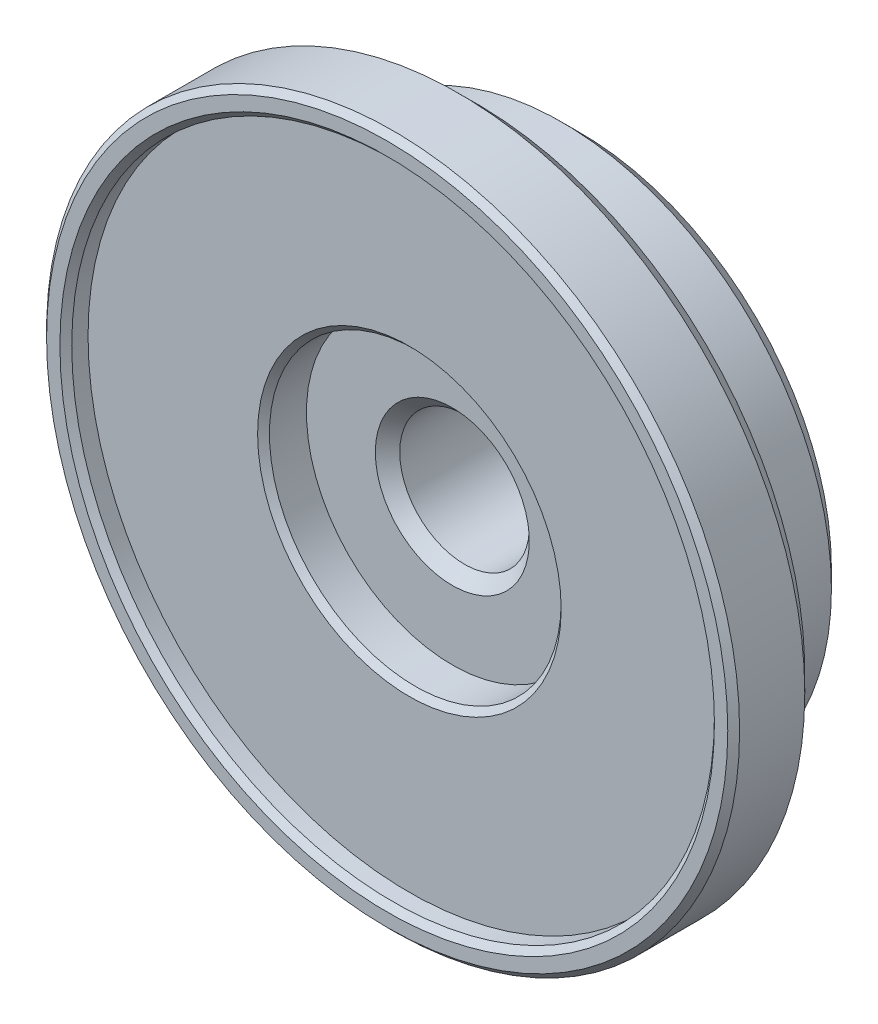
ISO-10303-21;
HEADER;
FILE_DESCRIPTION(('STEP AP214'),'2;1');
FILE_NAME('part.step','',(''),(''),'','','');
FILE_SCHEMA(('AUTOMOTIVE_DESIGN { 1 0 10303 214 1 1 1 1 }'));
ENDSEC;
DATA;
#1=APPLICATION_CONTEXT('core data for automotive mechanical design processes');
#2=APPLICATION_PROTOCOL_DEFINITION('international standard','automotive_design',2000,#1);
#3=PRODUCT_CONTEXT('',#1,'mechanical');
#4=PRODUCT('Part','Part','',(#3));
#5=PRODUCT_RELATED_PRODUCT_CATEGORY('part','',(#4));
#6=PRODUCT_DEFINITION_FORMATION('','',#4);
#7=PRODUCT_DEFINITION_CONTEXT('part definition',#1,'design');
#8=PRODUCT_DEFINITION('design','',#6,#7);
#9=PRODUCT_DEFINITION_SHAPE('','',#8);
#10=(LENGTH_UNIT() NAMED_UNIT(*) SI_UNIT(.MILLI.,.METRE.));
#11=(NAMED_UNIT(*) PLANE_ANGLE_UNIT() SI_UNIT($,.RADIAN.));
#12=(NAMED_UNIT(*) SI_UNIT($,.STERADIAN.) SOLID_ANGLE_UNIT());
#13=UNCERTAINTY_MEASURE_WITH_UNIT(LENGTH_MEASURE(1.E-05),#10,'distance_accuracy_value','');
#14=(GEOMETRIC_REPRESENTATION_CONTEXT(3) GLOBAL_UNCERTAINTY_ASSIGNED_CONTEXT((#13)) GLOBAL_UNIT_ASSIGNED_CONTEXT((#10,
#11,#12)) REPRESENTATION_CONTEXT('',''));
#15=CARTESIAN_POINT('',(0.,0.,0.));
#16=DIRECTION('',(0.,0.,1.));
#17=DIRECTION('',(1.,0.,0.));
#18=AXIS2_PLACEMENT_3D('',#15,#16,#17);
#19=CARTESIAN_POINT('',(0.,0.,-16.51));
#20=DIRECTION('',(0.,0.,1.));
#21=DIRECTION('',(1.,0.,0.));
#22=AXIS2_PLACEMENT_3D('',#19,#20,#21);
#23=CYLINDRICAL_SURFACE('',#22,29.718);
#24=CARTESIAN_POINT('',(0.,0.,-0.508000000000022));
#25=DIRECTION('',(0.,0.,1.));
#26=DIRECTION('',(1.,0.,0.));
#27=AXIS2_PLACEMENT_3D('',#24,#25,#26);
#28=CIRCLE('',#27,29.718);
#29=CARTESIAN_POINT('',(29.718,0.,-0.508000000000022));
#30=VERTEX_POINT('',#29);
#31=EDGE_CURVE('E32',#30,#30,#28,.F.);
#32=ORIENTED_EDGE('',*,*,#31,.T.);
#33=EDGE_LOOP('',(#32));
#34=FACE_BOUND('',#33,.T.);
#35=CARTESIAN_POINT('',(0.,0.,-6.09599999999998));
#36=DIRECTION('',(0.,0.,-1.));
#37=DIRECTION('',(-1.,0.,0.));
#38=AXIS2_PLACEMENT_3D('',#35,#36,#37);
#39=CIRCLE('',#38,29.718);
#40=CARTESIAN_POINT('',(-29.718,0.,-6.09599999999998));
#41=VERTEX_POINT('',#40);
#42=EDGE_CURVE('E57',#41,#41,#39,.F.);
#43=ORIENTED_EDGE('',*,*,#42,.T.);
#44=EDGE_LOOP('',(#43));
#45=FACE_BOUND('',#44,.T.);
#46=ADVANCED_FACE('F14',(#34,#45),#23,.T.);
#47=CARTESIAN_POINT('',(0.,0.,0.));
#48=DIRECTION('',(0.,0.,1.));
#49=DIRECTION('',(1.,0.,0.));
#50=AXIS2_PLACEMENT_3D('',#47,#48,#49);
#51=PLANE('',#50);
#52=CARTESIAN_POINT('',(0.,0.,0.));
#53=DIRECTION('',(0.,0.,1.));
#54=DIRECTION('',(1.,0.,0.));
#55=AXIS2_PLACEMENT_3D('',#52,#53,#54);
#56=CIRCLE('',#55,28.067);
#57=CARTESIAN_POINT('',(28.067,0.,0.));
#58=VERTEX_POINT('',#57);
#59=EDGE_CURVE('E93',#58,#58,#56,.F.);
#60=ORIENTED_EDGE('',*,*,#59,.T.);
#61=EDGE_LOOP('',(#60));
#62=FACE_BOUND('',#61,.T.);
#63=CARTESIAN_POINT('',(0.,0.,0.));
#64=DIRECTION('',(0.,0.,1.));
#65=DIRECTION('',(1.,0.,0.));
#66=AXIS2_PLACEMENT_3D('',#63,#64,#65);
#67=CIRCLE('',#66,29.21);
#68=CARTESIAN_POINT('',(29.21,0.,0.));
#69=VERTEX_POINT('',#68);
#70=EDGE_CURVE('E40',#69,#69,#67,.T.);
#71=ORIENTED_EDGE('',*,*,#70,.T.);
#72=EDGE_LOOP('',(#71));
#73=FACE_BOUND('',#72,.T.);
#74=ADVANCED_FACE('F131',(#62,#73),#51,.T.);
#75=CARTESIAN_POINT('',(0.,0.,-7.62));
#76=DIRECTION('',(0.,0.,-1.));
#77=DIRECTION('',(-1.,0.,0.));
#78=AXIS2_PLACEMENT_3D('',#75,#76,#77);
#79=PLANE('',#78);
#80=CARTESIAN_POINT('',(0.,0.,-7.62));
#81=DIRECTION('',(0.,0.,-1.));
#82=DIRECTION('',(-1.,0.,0.));
#83=AXIS2_PLACEMENT_3D('',#80,#81,#82);
#84=CIRCLE('',#83,23.876);
#85=CARTESIAN_POINT('',(-23.876,0.,-7.62));
#86=VERTEX_POINT('',#85);
#87=EDGE_CURVE('E9',#86,#86,#84,.F.);
#88=ORIENTED_EDGE('',*,*,#87,.T.);
#89=EDGE_LOOP('',(#88));
#90=FACE_BOUND('',#89,.T.);
#91=CARTESIAN_POINT('',(0.,0.,-7.62));
#92=DIRECTION('',(0.,0.,-1.));
#93=DIRECTION('',(-1.,0.,0.));
#94=AXIS2_PLACEMENT_3D('',#91,#92,#93);
#95=CIRCLE('',#94,28.194);
#96=CARTESIAN_POINT('',(-28.194,0.,-7.62));
#97=VERTEX_POINT('',#96);
#98=EDGE_CURVE('E54',#97,#97,#95,.T.);
#99=ORIENTED_EDGE('',*,*,#98,.T.);
#100=EDGE_LOOP('',(#99));
#101=FACE_BOUND('',#100,.T.);
#102=ADVANCED_FACE('F138',(#90,#101),#79,.T.);
#103=CARTESIAN_POINT('',(0.,0.,-7.62));
#104=DIRECTION('',(0.,0.,-1.));
#105=DIRECTION('',(-1.,0.,0.));
#106=AXIS2_PLACEMENT_3D('',#103,#104,#105);
#107=CYLINDRICAL_SURFACE('',#106,23.114);
#108=CARTESIAN_POINT('',(0.,0.,-8.382));
#109=DIRECTION('',(0.,0.,-1.));
#110=DIRECTION('',(-1.,0.,0.));
#111=AXIS2_PLACEMENT_3D('',#108,#109,#110);
#112=CIRCLE('',#111,23.114);
#113=CARTESIAN_POINT('',(-23.114,0.,-8.382));
#114=VERTEX_POINT('',#113);
#115=EDGE_CURVE('E22',#114,#114,#112,.T.);
#116=CARTESIAN_POINT('',(0.,0.,-14.9860000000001));
#117=DIRECTION('',(0.,0.,1.));
#118=DIRECTION('',(1.,0.,0.));
#119=AXIS2_PLACEMENT_3D('',#116,#117,#118);
#120=CIRCLE('',#119,23.114);
#121=CARTESIAN_POINT('',(-23.114,0.,-14.9860000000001));
#122=VERTEX_POINT('',#121);
#123=EDGE_CURVE('E46',#122,#122,#120,.T.);
#124=CARTESIAN_POINT('',(-23.114,0.,-8.382));
#125=CARTESIAN_POINT('',(-23.114,0.,-8.45079166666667));
#126=CARTESIAN_POINT('',(-23.114,0.,-8.51958333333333));
#127=CARTESIAN_POINT('',(-23.114,0.,-8.65716666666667));
#128=CARTESIAN_POINT('',(-23.114,0.,-8.72595833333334));
#129=CARTESIAN_POINT('',(-23.114,0.,-8.86354166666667));
#130=CARTESIAN_POINT('',(-23.114,0.,-8.93233333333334));
#131=CARTESIAN_POINT('',(-23.114,0.,-9.06991666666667));
#132=CARTESIAN_POINT('',(-23.114,0.,-9.13870833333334));
#133=CARTESIAN_POINT('',(-23.114,0.,-9.27629166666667));
#134=CARTESIAN_POINT('',(-23.114,0.,-9.34508333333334));
#135=CARTESIAN_POINT('',(-23.114,0.,-9.48266666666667));
#136=CARTESIAN_POINT('',(-23.114,0.,-9.55145833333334));
#137=CARTESIAN_POINT('',(-23.114,0.,-9.68904166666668));
#138=CARTESIAN_POINT('',(-23.114,0.,-9.75783333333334));
#139=CARTESIAN_POINT('',(-23.114,0.,-9.89541666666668));
#140=CARTESIAN_POINT('',(-23.114,0.,-9.96420833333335));
#141=CARTESIAN_POINT('',(-23.114,0.,-10.1017916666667));
#142=CARTESIAN_POINT('',(-23.114,0.,-10.1705833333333));
#143=CARTESIAN_POINT('',(-23.114,0.,-10.3081666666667));
#144=CARTESIAN_POINT('',(-23.114,0.,-10.3769583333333));
#145=CARTESIAN_POINT('',(-23.114,0.,-10.5145416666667));
#146=CARTESIAN_POINT('',(-23.114,0.,-10.5833333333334));
#147=CARTESIAN_POINT('',(-23.114,0.,-10.7209166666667));
#148=CARTESIAN_POINT('',(-23.114,0.,-10.7897083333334));
#149=CARTESIAN_POINT('',(-23.114,0.,-10.9272916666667));
#150=CARTESIAN_POINT('',(-23.114,0.,-10.9960833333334));
#151=CARTESIAN_POINT('',(-23.114,0.,-11.1336666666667));
#152=CARTESIAN_POINT('',(-23.114,0.,-11.2024583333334));
#153=CARTESIAN_POINT('',(-23.114,0.,-11.3400416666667));
#154=CARTESIAN_POINT('',(-23.114,0.,-11.4088333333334));
#155=CARTESIAN_POINT('',(-23.114,0.,-11.5464166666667));
#156=CARTESIAN_POINT('',(-23.114,0.,-11.6152083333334));
#157=CARTESIAN_POINT('',(-23.114,0.,-11.7527916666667));
#158=CARTESIAN_POINT('',(-23.114,0.,-11.8215833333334));
#159=CARTESIAN_POINT('',(-23.114,0.,-11.9591666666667));
#160=CARTESIAN_POINT('',(-23.114,0.,-12.0279583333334));
#161=CARTESIAN_POINT('',(-23.114,0.,-12.1655416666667));
#162=CARTESIAN_POINT('',(-23.114,0.,-12.2343333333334));
#163=CARTESIAN_POINT('',(-23.114,0.,-12.3719166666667));
#164=CARTESIAN_POINT('',(-23.114,0.,-12.4407083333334));
#165=CARTESIAN_POINT('',(-23.114,0.,-12.5782916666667));
#166=CARTESIAN_POINT('',(-23.114,0.,-12.6470833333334));
#167=CARTESIAN_POINT('',(-23.114,0.,-12.7846666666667));
#168=CARTESIAN_POINT('',(-23.114,0.,-12.8534583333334));
#169=CARTESIAN_POINT('',(-23.114,0.,-12.9910416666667));
#170=CARTESIAN_POINT('',(-23.114,0.,-13.0598333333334));
#171=CARTESIAN_POINT('',(-23.114,0.,-13.1974166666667));
#172=CARTESIAN_POINT('',(-23.114,0.,-13.2662083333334));
#173=CARTESIAN_POINT('',(-23.114,0.,-13.4037916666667));
#174=CARTESIAN_POINT('',(-23.114,0.,-13.4725833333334));
#175=CARTESIAN_POINT('',(-23.114,0.,-13.6101666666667));
#176=CARTESIAN_POINT('',(-23.114,0.,-13.6789583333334));
#177=CARTESIAN_POINT('',(-23.114,0.,-13.8165416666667));
#178=CARTESIAN_POINT('',(-23.114,0.,-13.8853333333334));
#179=CARTESIAN_POINT('',(-23.114,0.,-14.0229166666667));
#180=CARTESIAN_POINT('',(-23.114,0.,-14.0917083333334));
#181=CARTESIAN_POINT('',(-23.114,0.,-14.2292916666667));
#182=CARTESIAN_POINT('',(-23.114,0.,-14.2980833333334));
#183=CARTESIAN_POINT('',(-23.114,0.,-14.4356666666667));
#184=CARTESIAN_POINT('',(-23.114,0.,-14.5044583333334));
#185=CARTESIAN_POINT('',(-23.114,0.,-14.6420416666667));
#186=CARTESIAN_POINT('',(-23.114,0.,-14.7108333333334));
#187=CARTESIAN_POINT('',(-23.114,0.,-14.8484166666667));
#188=CARTESIAN_POINT('',(-23.114,0.,-14.9172083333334));
#189=CARTESIAN_POINT('',(-23.114,0.,-14.9860000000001));
#190=B_SPLINE_CURVE_WITH_KNOTS('',3,(#124,#125,#126,#127,#128,#129,#130,#131,#132,#133,#134,
#135,#136,#137,#138,#139,#140,#141,#142,#143,#144,#145,#146,#147,#148,#149,#150,#151,#152,#153,
#154,#155,#156,#157,#158,#159,#160,#161,#162,#163,#164,#165,#166,#167,#168,#169,#170,#171,#172,
#173,#174,#175,#176,#177,#178,#179,#180,#181,#182,#183,#184,#185,#186,#187,#188,#189),
.UNSPECIFIED.,.F.,.F.,(4,2,2,2,2,2,2,2,2,2,2,2,2,2,2,2,2,2,2,2,2,2,2,2,2,2,2,2,2,2,2,2,4),(0.,
0.206375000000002,0.412750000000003,0.619125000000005,0.825500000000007,1.03187500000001,
1.23825000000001,1.44462500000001,1.65100000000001,1.85737500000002,2.06375000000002,
2.27012500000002,2.47650000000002,2.68287500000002,2.88925000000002,3.09562500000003,
3.30200000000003,3.50837500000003,3.71475000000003,3.92112500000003,4.12750000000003,
4.33387500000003,4.54025000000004,4.74662500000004,4.95300000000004,5.15937500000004,
5.36575000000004,5.57212500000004,5.77850000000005,5.98487500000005,6.19125000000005,
6.39762500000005,6.60400000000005),.UNSPECIFIED.);
#191=EDGE_CURVE('BSEAM111',#114,#122,#190,.T.);
#192=ORIENTED_EDGE('',*,*,#115,.T.);
#193=ORIENTED_EDGE('',*,*,#123,.T.);
#194=ORIENTED_EDGE('',*,*,#191,.T.);
#195=ORIENTED_EDGE('',*,*,#191,.F.);
#196=EDGE_LOOP('',(#192,#194,#193,#195));
#197=FACE_BOUND('',#196,.T.);
#198=ADVANCED_FACE('F111',(#197),#107,.T.);
#199=CARTESIAN_POINT('',(0.,0.,-16.51));
#200=DIRECTION('',(0.,0.,1.));
#201=DIRECTION('',(1.,0.,0.));
#202=AXIS2_PLACEMENT_3D('',#199,#200,#201);
#203=PLANE('',#202);
#204=CARTESIAN_POINT('',(0.,0.,-16.51));
#205=DIRECTION('',(0.,0.,-1.));
#206=DIRECTION('',(-1.,0.,0.));
#207=AXIS2_PLACEMENT_3D('',#204,#205,#206);
#208=CIRCLE('',#207,6.604);
#209=CARTESIAN_POINT('',(-6.604,0.,-16.51));
#210=VERTEX_POINT('',#209);
#211=EDGE_CURVE('E97',#210,#210,#208,.T.);
#212=ORIENTED_EDGE('',*,*,#211,.F.);
#213=EDGE_LOOP('',(#212));
#214=FACE_BOUND('',#213,.T.);
#215=CARTESIAN_POINT('',(0.,0.,-16.51));
#216=DIRECTION('',(0.,0.,1.));
#217=DIRECTION('',(1.,0.,0.));
#218=AXIS2_PLACEMENT_3D('',#215,#216,#217);
#219=CIRCLE('',#218,21.59);
#220=CARTESIAN_POINT('',(21.59,0.,-16.51));
#221=VERTEX_POINT('',#220);
#222=EDGE_CURVE('E50',#221,#221,#219,.F.);
#223=ORIENTED_EDGE('',*,*,#222,.T.);
#224=EDGE_LOOP('',(#223));
#225=FACE_BOUND('',#224,.T.);
#226=ADVANCED_FACE('F107',(#214,#225),#203,.F.);
#227=CARTESIAN_POINT('',(0.,0.,-6.09599999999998));
#228=DIRECTION('',(0.,0.,1.));
#229=DIRECTION('',(1.,0.,0.));
#230=AXIS2_PLACEMENT_3D('',#227,#228,#229);
#231=CONICAL_SURFACE('',#230,29.718,0.785398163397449);
#232=ORIENTED_EDGE('',*,*,#98,.F.);
#233=EDGE_LOOP('',(#232));
#234=FACE_BOUND('',#233,.T.);
#235=ORIENTED_EDGE('',*,*,#42,.F.);
#236=EDGE_LOOP('',(#235));
#237=FACE_BOUND('',#236,.T.);
#238=ADVANCED_FACE('F110',(#234,#237),#231,.T.);
#239=CARTESIAN_POINT('',(0.,0.,-16.51));
#240=DIRECTION('',(0.,0.,1.));
#241=DIRECTION('',(1.,0.,0.));
#242=AXIS2_PLACEMENT_3D('',#239,#240,#241);
#243=CONICAL_SURFACE('',#242,21.59,0.785398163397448);
#244=ORIENTED_EDGE('',*,*,#123,.F.);
#245=EDGE_LOOP('',(#244));
#246=FACE_BOUND('',#245,.T.);
#247=ORIENTED_EDGE('',*,*,#222,.F.);
#248=EDGE_LOOP('',(#247));
#249=FACE_BOUND('',#248,.T.);
#250=ADVANCED_FACE('F115',(#246,#249),#243,.T.);
#251=CARTESIAN_POINT('',(0.,0.,0.));
#252=DIRECTION('',(0.,0.,-1.));
#253=DIRECTION('',(-1.,0.,0.));
#254=AXIS2_PLACEMENT_3D('',#251,#252,#253);
#255=CONICAL_SURFACE('',#254,29.21,0.785398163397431);
#256=ORIENTED_EDGE('',*,*,#31,.F.);
#257=EDGE_LOOP('',(#256));
#258=FACE_BOUND('',#257,.T.);
#259=ORIENTED_EDGE('',*,*,#70,.F.);
#260=EDGE_LOOP('',(#259));
#261=FACE_BOUND('',#260,.T.);
#262=ADVANCED_FACE('F117',(#258,#261),#255,.T.);
#263=CARTESIAN_POINT('',(0.,0.,-8.382));
#264=DIRECTION('',(0.,0.,-1.));
#265=DIRECTION('',(-1.,0.,0.));
#266=AXIS2_PLACEMENT_3D('',#263,#264,#265);
#267=TOROIDAL_SURFACE('',#266,23.876,0.762);
#268=ORIENTED_EDGE('',*,*,#87,.F.);
#269=EDGE_LOOP('',(#268));
#270=FACE_BOUND('',#269,.T.);
#271=ORIENTED_EDGE('',*,*,#115,.F.);
#272=EDGE_LOOP('',(#271));
#273=FACE_BOUND('',#272,.T.);
#274=ADVANCED_FACE('F16',(#270,#273),#267,.F.);
#275=CARTESIAN_POINT('',(0.,0.,-0.507999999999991));
#276=DIRECTION('',(0.,0.,1.));
#277=DIRECTION('',(1.,0.,0.));
#278=AXIS2_PLACEMENT_3D('',#275,#276,#277);
#279=CONICAL_SURFACE('',#278,27.559,0.785398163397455);
#280=ORIENTED_EDGE('',*,*,#59,.F.);
#281=EDGE_LOOP('',(#280));
#282=FACE_BOUND('',#281,.T.);
#283=CARTESIAN_POINT('',(0.,0.,-0.507999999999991));
#284=DIRECTION('',(0.,0.,1.));
#285=DIRECTION('',(1.,0.,0.));
#286=AXIS2_PLACEMENT_3D('',#283,#284,#285);
#287=CIRCLE('',#286,27.559);
#288=CARTESIAN_POINT('',(27.559,0.,-0.507999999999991));
#289=VERTEX_POINT('',#288);
#290=EDGE_CURVE('E85',#289,#289,#287,.T.);
#291=ORIENTED_EDGE('',*,*,#290,.F.);
#292=EDGE_LOOP('',(#291));
#293=FACE_BOUND('',#292,.T.);
#294=ADVANCED_FACE('F147',(#282,#293),#279,.F.);
#295=CARTESIAN_POINT('',(0.,0.,-16.51));
#296=DIRECTION('',(0.,0.,-1.));
#297=DIRECTION('',(-1.,0.,0.));
#298=AXIS2_PLACEMENT_3D('',#295,#296,#297);
#299=CONICAL_SURFACE('',#298,6.604,0.785398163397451);
#300=CARTESIAN_POINT('',(0.,0.,-15.46225));
#301=DIRECTION('',(0.,0.,-1.));
#302=DIRECTION('',(-1.,0.,0.));
#303=AXIS2_PLACEMENT_3D('',#300,#301,#302);
#304=CIRCLE('',#303,5.55625);
#305=CARTESIAN_POINT('',(-5.55625,0.,-15.46225));
#306=VERTEX_POINT('',#305);
#307=EDGE_CURVE('E61',#306,#306,#304,.T.);
#308=ORIENTED_EDGE('',*,*,#307,.F.);
#309=EDGE_LOOP('',(#308));
#310=FACE_BOUND('',#309,.T.);
#311=ORIENTED_EDGE('',*,*,#211,.T.);
#312=EDGE_LOOP('',(#311));
#313=FACE_BOUND('',#312,.T.);
#314=ADVANCED_FACE('F105',(#310,#313),#299,.F.);
#315=CARTESIAN_POINT('',(0.,0.,-16.51));
#316=DIRECTION('',(0.,0.,-1.));
#317=DIRECTION('',(-1.,0.,0.));
#318=AXIS2_PLACEMENT_3D('',#315,#316,#317);
#319=CYLINDRICAL_SURFACE('',#318,5.55625);
#320=CARTESIAN_POINT('',(0.,0.,-6.63575));
#321=DIRECTION('',(0.,0.,-1.));
#322=DIRECTION('',(-1.,0.,0.));
#323=AXIS2_PLACEMENT_3D('',#320,#321,#322);
#324=CIRCLE('',#323,5.55625);
#325=CARTESIAN_POINT('',(-5.55625,0.,-6.63575));
#326=VERTEX_POINT('',#325);
#327=EDGE_CURVE('E65',#326,#326,#324,.T.);
#328=ORIENTED_EDGE('',*,*,#327,.F.);
#329=EDGE_LOOP('',(#328));
#330=FACE_BOUND('',#329,.T.);
#331=ORIENTED_EDGE('',*,*,#307,.T.);
#332=EDGE_LOOP('',(#331));
#333=FACE_BOUND('',#332,.T.);
#334=ADVANCED_FACE('F153',(#330,#333),#319,.F.);
#335=CARTESIAN_POINT('',(0.,0.,-6.63575));
#336=DIRECTION('',(0.,0.,1.));
#337=DIRECTION('',(1.,0.,0.));
#338=AXIS2_PLACEMENT_3D('',#335,#336,#337);
#339=CONICAL_SURFACE('',#338,5.55625,0.78539816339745);
#340=CARTESIAN_POINT('',(0.,0.,-5.588));
#341=DIRECTION('',(0.,0.,-1.));
#342=DIRECTION('',(-1.,0.,0.));
#343=AXIS2_PLACEMENT_3D('',#340,#341,#342);
#344=CIRCLE('',#343,6.604);
#345=CARTESIAN_POINT('',(-6.604,0.,-5.588));
#346=VERTEX_POINT('',#345);
#347=EDGE_CURVE('E69',#346,#346,#344,.T.);
#348=ORIENTED_EDGE('',*,*,#347,.F.);
#349=EDGE_LOOP('',(#348));
#350=FACE_BOUND('',#349,.T.);
#351=ORIENTED_EDGE('',*,*,#327,.T.);
#352=EDGE_LOOP('',(#351));
#353=FACE_BOUND('',#352,.T.);
#354=ADVANCED_FACE('F157',(#350,#353),#339,.F.);
#355=CARTESIAN_POINT('',(0.,0.,-5.588));
#356=DIRECTION('',(0.,0.,1.));
#357=DIRECTION('',(1.,0.,0.));
#358=AXIS2_PLACEMENT_3D('',#355,#356,#357);
#359=PLANE('',#358);
#360=ORIENTED_EDGE('',*,*,#347,.T.);
#361=EDGE_LOOP('',(#360));
#362=FACE_BOUND('',#361,.T.);
#363=CARTESIAN_POINT('',(0.,0.,-5.588));
#364=DIRECTION('',(0.,0.,1.));
#365=DIRECTION('',(1.,0.,0.));
#366=AXIS2_PLACEMENT_3D('',#363,#364,#365);
#367=CIRCLE('',#366,12.5095);
#368=CARTESIAN_POINT('',(12.5095,0.,-5.588));
#369=VERTEX_POINT('',#368);
#370=EDGE_CURVE('E73',#369,#369,#367,.T.);
#371=ORIENTED_EDGE('',*,*,#370,.T.);
#372=EDGE_LOOP('',(#371));
#373=FACE_BOUND('',#372,.T.);
#374=ADVANCED_FACE('F161',(#362,#373),#359,.T.);
#375=CARTESIAN_POINT('',(0.,0.,-5.588));
#376=DIRECTION('',(0.,0.,1.));
#377=DIRECTION('',(1.,0.,0.));
#378=AXIS2_PLACEMENT_3D('',#375,#376,#377);
#379=CYLINDRICAL_SURFACE('',#378,12.5095);
#380=CARTESIAN_POINT('',(0.,0.,-2.41299999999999));
#381=DIRECTION('',(0.,0.,1.));
#382=DIRECTION('',(1.,0.,0.));
#383=AXIS2_PLACEMENT_3D('',#380,#381,#382);
#384=CIRCLE('',#383,12.5095);
#385=CARTESIAN_POINT('',(12.5095,0.,-2.41299999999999));
#386=VERTEX_POINT('',#385);
#387=EDGE_CURVE('E77',#386,#386,#384,.T.);
#388=ORIENTED_EDGE('',*,*,#387,.T.);
#389=EDGE_LOOP('',(#388));
#390=FACE_BOUND('',#389,.T.);
#391=ORIENTED_EDGE('',*,*,#370,.F.);
#392=EDGE_LOOP('',(#391));
#393=FACE_BOUND('',#392,.T.);
#394=ADVANCED_FACE('F165',(#390,#393),#379,.F.);
#395=CARTESIAN_POINT('',(0.,0.,-1.905));
#396=DIRECTION('',(0.,0.,1.));
#397=DIRECTION('',(1.,0.,0.));
#398=AXIS2_PLACEMENT_3D('',#395,#396,#397);
#399=CONICAL_SURFACE('',#398,13.0175,0.785398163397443);
#400=ORIENTED_EDGE('',*,*,#387,.F.);
#401=EDGE_LOOP('',(#400));
#402=FACE_BOUND('',#401,.T.);
#403=CARTESIAN_POINT('',(0.,0.,-1.905));
#404=DIRECTION('',(0.,0.,1.));
#405=DIRECTION('',(1.,0.,0.));
#406=AXIS2_PLACEMENT_3D('',#403,#404,#405);
#407=CIRCLE('',#406,13.0175);
#408=CARTESIAN_POINT('',(13.0175,0.,-1.905));
#409=VERTEX_POINT('',#408);
#410=EDGE_CURVE('E81',#409,#409,#407,.F.);
#411=ORIENTED_EDGE('',*,*,#410,.F.);
#412=EDGE_LOOP('',(#411));
#413=FACE_BOUND('',#412,.T.);
#414=ADVANCED_FACE('F169',(#402,#413),#399,.F.);
#415=CARTESIAN_POINT('',(0.,0.,-1.905));
#416=DIRECTION('',(0.,0.,1.));
#417=DIRECTION('',(1.,0.,0.));
#418=AXIS2_PLACEMENT_3D('',#415,#416,#417);
#419=PLANE('',#418);
#420=ORIENTED_EDGE('',*,*,#410,.T.);
#421=EDGE_LOOP('',(#420));
#422=FACE_BOUND('',#421,.T.);
#423=CARTESIAN_POINT('',(0.,0.,-1.905));
#424=DIRECTION('',(0.,0.,1.));
#425=DIRECTION('',(1.,0.,0.));
#426=AXIS2_PLACEMENT_3D('',#423,#424,#425);
#427=CIRCLE('',#426,27.559);
#428=CARTESIAN_POINT('',(27.559,0.,-1.905));
#429=VERTEX_POINT('',#428);
#430=EDGE_CURVE('E89',#429,#429,#427,.F.);
#431=ORIENTED_EDGE('',*,*,#430,.F.);
#432=EDGE_LOOP('',(#431));
#433=FACE_BOUND('',#432,.T.);
#434=ADVANCED_FACE('F173',(#422,#433),#419,.T.);
#435=CARTESIAN_POINT('',(0.,0.,-4.699));
#436=DIRECTION('',(0.,0.,1.));
#437=DIRECTION('',(1.,0.,0.));
#438=AXIS2_PLACEMENT_3D('',#435,#436,#437);
#439=CYLINDRICAL_SURFACE('',#438,27.559);
#440=ORIENTED_EDGE('',*,*,#430,.T.);
#441=EDGE_LOOP('',(#440));
#442=FACE_BOUND('',#441,.T.);
#443=ORIENTED_EDGE('',*,*,#290,.T.);
#444=EDGE_LOOP('',(#443));
#445=FACE_BOUND('',#444,.T.);
#446=ADVANCED_FACE('F177',(#442,#445),#439,.F.);
#447=CLOSED_SHELL('',(#46,#74,#102,#198,#226,#238,#250,#262,#274,#294,#314,#334,#354,#374,#394,
#414,#434,#446));
#448=MANIFOLD_SOLID_BREP('B1',#447);
#449=ADVANCED_BREP_SHAPE_REPRESENTATION('',(#18,#448),#14);
#450=SHAPE_DEFINITION_REPRESENTATION(#9,#449);
ENDSEC;
END-ISO-10303-21;
